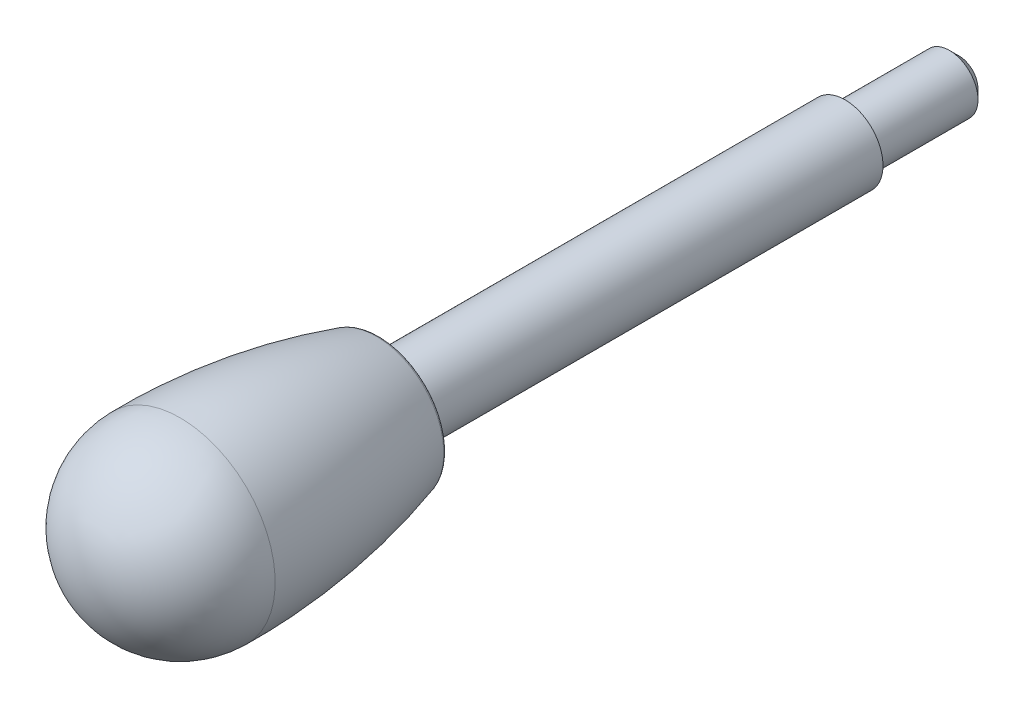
ISO-10303-21;
HEADER;
FILE_DESCRIPTION(('STEP AP214'),'2;1');
FILE_NAME('part.step','',(''),(''),'','','');
FILE_SCHEMA(('AUTOMOTIVE_DESIGN { 1 0 10303 214 1 1 1 1 }'));
ENDSEC;
DATA;
#1=APPLICATION_CONTEXT('core data for automotive mechanical design processes');
#2=APPLICATION_PROTOCOL_DEFINITION('international standard','automotive_design',2000,#1);
#3=PRODUCT_CONTEXT('',#1,'mechanical');
#4=PRODUCT('Part','Part','',(#3));
#5=PRODUCT_RELATED_PRODUCT_CATEGORY('part','',(#4));
#6=PRODUCT_DEFINITION_FORMATION('','',#4);
#7=PRODUCT_DEFINITION_CONTEXT('part definition',#1,'design');
#8=PRODUCT_DEFINITION('design','',#6,#7);
#9=PRODUCT_DEFINITION_SHAPE('','',#8);
#10=(LENGTH_UNIT() NAMED_UNIT(*) SI_UNIT(.MILLI.,.METRE.));
#11=(NAMED_UNIT(*) PLANE_ANGLE_UNIT() SI_UNIT($,.RADIAN.));
#12=(NAMED_UNIT(*) SI_UNIT($,.STERADIAN.) SOLID_ANGLE_UNIT());
#13=UNCERTAINTY_MEASURE_WITH_UNIT(LENGTH_MEASURE(1.E-05),#10,'distance_accuracy_value','');
#14=(GEOMETRIC_REPRESENTATION_CONTEXT(3) GLOBAL_UNCERTAINTY_ASSIGNED_CONTEXT((#13)) GLOBAL_UNIT_ASSIGNED_CONTEXT((#10,
#11,#12)) REPRESENTATION_CONTEXT('',''));
#15=CARTESIAN_POINT('',(0.,0.,0.));
#16=DIRECTION('',(0.,0.,1.));
#17=DIRECTION('',(1.,0.,0.));
#18=AXIS2_PLACEMENT_3D('',#15,#16,#17);
#19=CARTESIAN_POINT('',(0.,0.,-46.9796802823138));
#20=DIRECTION('',(0.,0.,-1.));
#21=DIRECTION('',(-1.,0.,0.));
#22=AXIS2_PLACEMENT_3D('',#19,#20,#21);
#23=CYLINDRICAL_SURFACE('',#22,3.);
#24=CARTESIAN_POINT('',(0.,0.,-11.));
#25=DIRECTION('',(0.,0.,-1.));
#26=DIRECTION('',(-1.,0.,0.));
#27=AXIS2_PLACEMENT_3D('',#24,#25,#26);
#28=CIRCLE('',#27,3.);
#29=CARTESIAN_POINT('',(-3.,0.,-11.));
#30=VERTEX_POINT('',#29);
#31=EDGE_CURVE('E40',#30,#30,#28,.T.);
#32=ORIENTED_EDGE('',*,*,#31,.F.);
#33=EDGE_LOOP('',(#32));
#34=FACE_BOUND('',#33,.T.);
#35=CARTESIAN_POINT('',(0.,0.,0.));
#36=DIRECTION('',(0.,0.,-1.));
#37=DIRECTION('',(-1.,0.,0.));
#38=AXIS2_PLACEMENT_3D('',#35,#36,#37);
#39=CIRCLE('',#38,3.);
#40=CARTESIAN_POINT('',(-3.,0.,0.));
#41=VERTEX_POINT('',#40);
#42=EDGE_CURVE('E8',#41,#41,#39,.T.);
#43=ORIENTED_EDGE('',*,*,#42,.T.);
#44=EDGE_LOOP('',(#43));
#45=FACE_BOUND('',#44,.T.);
#46=ADVANCED_FACE('F12',(#34,#45),#23,.T.);
#47=CARTESIAN_POINT('',(0.,-4.,0.));
#48=DIRECTION('',(0.,0.,1.));
#49=DIRECTION('',(1.,0.,0.));
#50=AXIS2_PLACEMENT_3D('',#47,#48,#49);
#51=PLANE('',#50);
#52=ORIENTED_EDGE('',*,*,#42,.F.);
#53=EDGE_LOOP('',(#52));
#54=FACE_BOUND('',#53,.T.);
#55=CARTESIAN_POINT('',(0.,0.,0.));
#56=DIRECTION('',(0.,0.,-1.));
#57=DIRECTION('',(-1.,0.,0.));
#58=AXIS2_PLACEMENT_3D('',#55,#56,#57);
#59=CIRCLE('',#58,4.);
#60=CARTESIAN_POINT('',(-4.,0.,0.));
#61=VERTEX_POINT('',#60);
#62=EDGE_CURVE('E18',#61,#61,#59,.T.);
#63=ORIENTED_EDGE('',*,*,#62,.T.);
#64=EDGE_LOOP('',(#63));
#65=FACE_BOUND('',#64,.T.);
#66=ADVANCED_FACE('F47',(#54,#65),#51,.F.);
#67=CARTESIAN_POINT('',(0.,0.,-46.9796802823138));
#68=DIRECTION('',(0.,0.,-1.));
#69=DIRECTION('',(-1.,0.,0.));
#70=AXIS2_PLACEMENT_3D('',#67,#68,#69);
#71=CYLINDRICAL_SURFACE('',#70,4.);
#72=ORIENTED_EDGE('',*,*,#62,.F.);
#73=EDGE_LOOP('',(#72));
#74=FACE_BOUND('',#73,.T.);
#75=CARTESIAN_POINT('',(0.,0.,49.));
#76=DIRECTION('',(0.,0.,-1.));
#77=DIRECTION('',(-1.,0.,0.));
#78=AXIS2_PLACEMENT_3D('',#75,#76,#77);
#79=CIRCLE('',#78,4.);
#80=CARTESIAN_POINT('',(-4.,0.,49.));
#81=VERTEX_POINT('',#80);
#82=EDGE_CURVE('E22',#81,#81,#79,.T.);
#83=ORIENTED_EDGE('',*,*,#82,.T.);
#84=EDGE_LOOP('',(#83));
#85=FACE_BOUND('',#84,.T.);
#86=ADVANCED_FACE('F53',(#74,#85),#71,.T.);
#87=CARTESIAN_POINT('',(0.,-6.62794066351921,49.));
#88=DIRECTION('',(0.,0.,1.));
#89=DIRECTION('',(1.,0.,0.));
#90=AXIS2_PLACEMENT_3D('',#87,#88,#89);
#91=PLANE('',#90);
#92=ORIENTED_EDGE('',*,*,#82,.F.);
#93=EDGE_LOOP('',(#92));
#94=FACE_BOUND('',#93,.T.);
#95=CARTESIAN_POINT('',(0.,0.,49.));
#96=DIRECTION('',(0.,0.,-1.));
#97=DIRECTION('',(-1.,0.,0.));
#98=AXIS2_PLACEMENT_3D('',#95,#96,#97);
#99=CIRCLE('',#98,6.62794066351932);
#100=CARTESIAN_POINT('',(-6.62794066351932,0.,49.));
#101=VERTEX_POINT('',#100);
#102=EDGE_CURVE('E26',#101,#101,#99,.T.);
#103=ORIENTED_EDGE('',*,*,#102,.T.);
#104=EDGE_LOOP('',(#103));
#105=FACE_BOUND('',#104,.T.);
#106=ADVANCED_FACE('F59',(#94,#105),#91,.F.);
#107=CARTESIAN_POINT('',(0.,0.,49.5));
#108=DIRECTION('',(0.,0.,-1.));
#109=DIRECTION('',(-1.,0.,0.));
#110=AXIS2_PLACEMENT_3D('',#107,#108,#109);
#111=TOROIDAL_SURFACE('',#110,6.62794066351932,0.500000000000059);
#112=ORIENTED_EDGE('',*,*,#102,.F.);
#113=EDGE_LOOP('',(#112));
#114=FACE_BOUND('',#113,.T.);
#115=CARTESIAN_POINT('',(0.,0.,49.357660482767));
#116=DIRECTION('',(0.,0.,-1.));
#117=DIRECTION('',(-1.,0.,0.));
#118=AXIS2_PLACEMENT_3D('',#115,#116,#117);
#119=CIRCLE('',#118,7.10725210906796);
#120=CARTESIAN_POINT('',(-7.10725210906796,0.,49.357660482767));
#121=VERTEX_POINT('',#120);
#122=EDGE_CURVE('E31',#121,#121,#119,.T.);
#123=ORIENTED_EDGE('',*,*,#122,.T.);
#124=EDGE_LOOP('',(#123));
#125=FACE_BOUND('',#124,.T.);
#126=ADVANCED_FACE('F65',(#114,#125),#111,.T.);
#127=CARTESIAN_POINT('',(0.,0.,69.2851928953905));
#128=DIRECTION('',(0.,0.,-1.));
#129=DIRECTION('',(-1.,0.,0.));
#130=AXIS2_PLACEMENT_3D('',#127,#128,#129);
#131=DEGENERATE_TOROIDAL_SURFACE('',#130,59.9963502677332,70.,.F.);
#132=ORIENTED_EDGE('',*,*,#122,.F.);
#133=EDGE_LOOP('',(#132));
#134=FACE_BOUND('',#133,.T.);
#135=CARTESIAN_POINT('',(0.,0.,70.));
#136=DIRECTION('',(0.,0.,-1.));
#137=DIRECTION('',(-1.,0.,0.));
#138=AXIS2_PLACEMENT_3D('',#135,#136,#137);
#139=CIRCLE('',#138,10.);
#140=CARTESIAN_POINT('',(-10.,0.,70.));
#141=VERTEX_POINT('',#140);
#142=EDGE_CURVE('E34',#141,#141,#139,.T.);
#143=ORIENTED_EDGE('',*,*,#142,.T.);
#144=EDGE_LOOP('',(#143));
#145=FACE_BOUND('',#144,.T.);
#146=ADVANCED_FACE('F69',(#134,#145),#131,.F.);
#147=CARTESIAN_POINT('',(0.,0.,70.));
#148=DIRECTION('',(-1.,0.,0.));
#149=DIRECTION('',(0.,0.,1.));
#150=AXIS2_PLACEMENT_3D('',#147,#148,#149);
#151=SPHERICAL_SURFACE('',#150,10.);
#152=CARTESIAN_POINT('',(0.,0.,70.));
#153=DIRECTION('',(0.,0.,-1.));
#154=DIRECTION('',(-1.,0.,0.));
#155=AXIS2_PLACEMENT_3D('',#152,#153,#154);
#156=SPHERICAL_SURFACE('',#155,10.);
#157=ORIENTED_EDGE('',*,*,#142,.F.);
#158=EDGE_LOOP('',(#157));
#159=FACE_BOUND('',#158,.T.);
#160=ADVANCED_FACE('F73',(#159),#156,.T.);
#161=CARTESIAN_POINT('',(0.,0.,-12.));
#162=DIRECTION('',(0.,0.,-1.));
#163=DIRECTION('',(-1.,0.,0.));
#164=AXIS2_PLACEMENT_3D('',#161,#162,#163);
#165=PLANE('',#164);
#166=CARTESIAN_POINT('',(0.,0.,-12.));
#167=DIRECTION('',(0.,0.,-1.));
#168=DIRECTION('',(-1.,0.,0.));
#169=AXIS2_PLACEMENT_3D('',#166,#167,#168);
#170=CIRCLE('',#169,1.99999999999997);
#171=CARTESIAN_POINT('',(-1.99999999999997,0.,-12.));
#172=VERTEX_POINT('',#171);
#173=EDGE_CURVE('E37',#172,#172,#170,.T.);
#174=ORIENTED_EDGE('',*,*,#173,.T.);
#175=EDGE_LOOP('',(#174));
#176=FACE_BOUND('',#175,.T.);
#177=ADVANCED_FACE('F77',(#176),#165,.T.);
#178=CARTESIAN_POINT('',(0.,0.,-11.));
#179=DIRECTION('',(0.,0.,1.));
#180=DIRECTION('',(1.,0.,0.));
#181=AXIS2_PLACEMENT_3D('',#178,#179,#180);
#182=CONICAL_SURFACE('',#181,3.,0.785398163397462);
#183=ORIENTED_EDGE('',*,*,#173,.F.);
#184=EDGE_LOOP('',(#183));
#185=FACE_BOUND('',#184,.T.);
#186=ORIENTED_EDGE('',*,*,#31,.T.);
#187=EDGE_LOOP('',(#186));
#188=FACE_BOUND('',#187,.T.);
#189=ADVANCED_FACE('F44',(#185,#188),#182,.T.);
#190=CLOSED_SHELL('',(#46,#66,#86,#106,#126,#146,#160,#177,#189));
#191=MANIFOLD_SOLID_BREP('B1',#190);
#192=ADVANCED_BREP_SHAPE_REPRESENTATION('',(#18,#191),#14);
#193=SHAPE_DEFINITION_REPRESENTATION(#9,#192);
ENDSEC;
END-ISO-10303-21;
